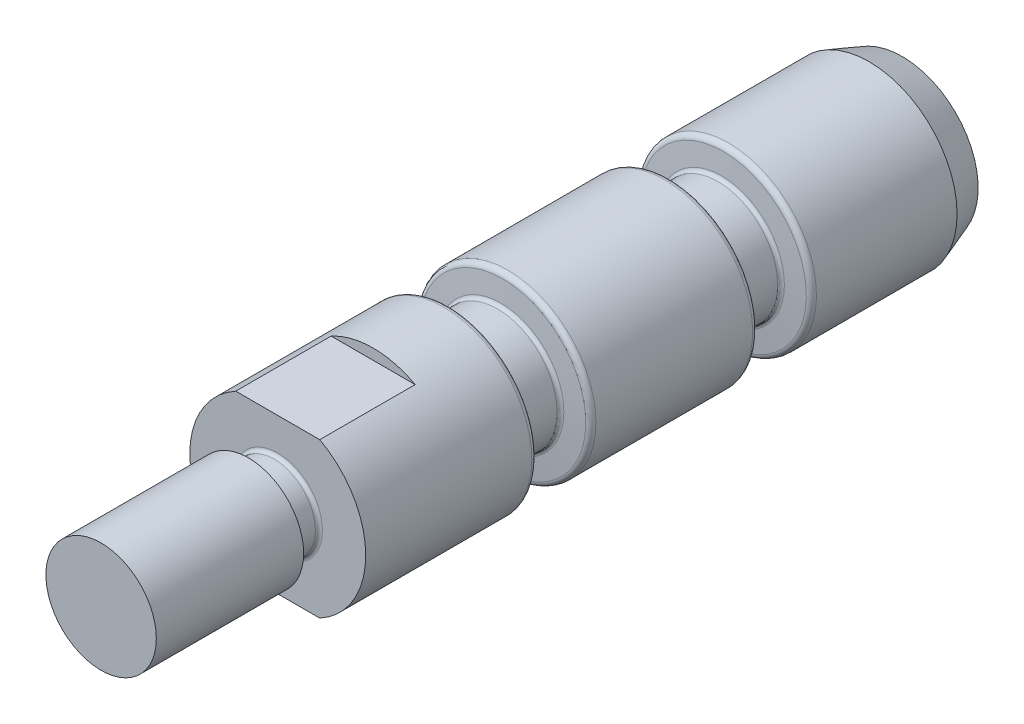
ISO-10303-21;
HEADER;
FILE_DESCRIPTION(('STEP AP214'),'2;1');
FILE_NAME('part.step','',(''),(''),'','','');
FILE_SCHEMA(('AUTOMOTIVE_DESIGN { 1 0 10303 214 1 1 1 1 }'));
ENDSEC;
DATA;
#1=APPLICATION_CONTEXT('core data for automotive mechanical design processes');
#2=APPLICATION_PROTOCOL_DEFINITION('international standard','automotive_design',2000,#1);
#3=PRODUCT_CONTEXT('',#1,'mechanical');
#4=PRODUCT('Part','Part','',(#3));
#5=PRODUCT_RELATED_PRODUCT_CATEGORY('part','',(#4));
#6=PRODUCT_DEFINITION_FORMATION('','',#4);
#7=PRODUCT_DEFINITION_CONTEXT('part definition',#1,'design');
#8=PRODUCT_DEFINITION('design','',#6,#7);
#9=PRODUCT_DEFINITION_SHAPE('','',#8);
#10=(LENGTH_UNIT() NAMED_UNIT(*) SI_UNIT(.MILLI.,.METRE.));
#11=(NAMED_UNIT(*) PLANE_ANGLE_UNIT() SI_UNIT($,.RADIAN.));
#12=(NAMED_UNIT(*) SI_UNIT($,.STERADIAN.) SOLID_ANGLE_UNIT());
#13=UNCERTAINTY_MEASURE_WITH_UNIT(LENGTH_MEASURE(1.E-05),#10,'distance_accuracy_value','');
#14=(GEOMETRIC_REPRESENTATION_CONTEXT(3) GLOBAL_UNCERTAINTY_ASSIGNED_CONTEXT((#13)) GLOBAL_UNIT_ASSIGNED_CONTEXT((#10,
#11,#12)) REPRESENTATION_CONTEXT('',''));
#15=CARTESIAN_POINT('',(0.,0.,0.));
#16=DIRECTION('',(0.,0.,1.));
#17=DIRECTION('',(1.,0.,0.));
#18=AXIS2_PLACEMENT_3D('',#15,#16,#17);
#19=CARTESIAN_POINT('',(-82.55,82.5500000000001,-44.8945));
#20=DIRECTION('',(0.,0.,1.));
#21=DIRECTION('',(1.,0.,0.));
#22=AXIS2_PLACEMENT_3D('',#19,#20,#21);
#23=CYLINDRICAL_SURFACE('',#22,6.32459999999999);
#24=CARTESIAN_POINT('',(-82.55,82.5500000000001,-11.9403527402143));
#25=DIRECTION('',(0.,0.,1.));
#26=DIRECTION('',(0.,-1.,0.));
#27=AXIS2_PLACEMENT_3D('',#24,#25,#26);
#28=CIRCLE('',#27,6.32459999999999);
#29=CARTESIAN_POINT('',(-82.55,76.2254000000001,-11.9403527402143));
#30=VERTEX_POINT('',#29);
#31=EDGE_CURVE('E135',#30,#30,#28,.T.);
#32=ORIENTED_EDGE('',*,*,#31,.T.);
#33=EDGE_LOOP('',(#32));
#34=FACE_BOUND('',#33,.T.);
#35=CARTESIAN_POINT('',(-82.55,82.5500000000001,-6.858));
#36=DIRECTION('',(0.,0.,-1.));
#37=DIRECTION('',(-1.,0.,0.));
#38=AXIS2_PLACEMENT_3D('',#35,#36,#37);
#39=CIRCLE('',#38,6.32459999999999);
#40=CARTESIAN_POINT('',(-79.5286342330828,76.99375,-6.858));
#41=VERTEX_POINT('',#40);
#42=CARTESIAN_POINT('',(-85.5713657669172,76.99375,-6.858));
#43=VERTEX_POINT('',#42);
#44=EDGE_CURVE('E89',#41,#43,#39,.T.);
#45=ORIENTED_EDGE('',*,*,#44,.T.);
#46=DIRECTION('',(0.,0.,1.));
#47=VECTOR('',#46,1.);
#48=CARTESIAN_POINT('',(-85.5713657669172,76.99375,-44.8945));
#49=LINE('',#48,#47);
#50=CARTESIAN_POINT('',(-85.5713657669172,76.99375,0.));
#51=VERTEX_POINT('',#50);
#52=EDGE_CURVE('E84',#43,#51,#49,.T.);
#53=ORIENTED_EDGE('',*,*,#52,.T.);
#54=CARTESIAN_POINT('',(-82.55,82.5500000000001,0.));
#55=DIRECTION('',(0.,0.,-1.));
#56=DIRECTION('',(-1.,0.,0.));
#57=AXIS2_PLACEMENT_3D('',#54,#55,#56);
#58=CIRCLE('',#57,6.32459999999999);
#59=CARTESIAN_POINT('',(-85.5713657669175,88.10625,0.));
#60=VERTEX_POINT('',#59);
#61=EDGE_CURVE('E61',#51,#60,#58,.T.);
#62=ORIENTED_EDGE('',*,*,#61,.T.);
#63=DIRECTION('',(0.,0.,1.));
#64=VECTOR('',#63,1.);
#65=CARTESIAN_POINT('',(-85.5713657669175,88.10625,-44.8945));
#66=LINE('',#65,#64);
#67=CARTESIAN_POINT('',(-85.5713657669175,88.10625,-6.858));
#68=VERTEX_POINT('',#67);
#69=EDGE_CURVE('E202',#60,#68,#66,.F.);
#70=ORIENTED_EDGE('',*,*,#69,.T.);
#71=CARTESIAN_POINT('',(-82.55,82.5500000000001,-6.85800000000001));
#72=DIRECTION('',(0.,0.,-1.));
#73=DIRECTION('',(0.,1.,0.));
#74=AXIS2_PLACEMENT_3D('',#71,#72,#73);
#75=CIRCLE('',#74,6.32459999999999);
#76=CARTESIAN_POINT('',(-79.5286342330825,88.10625,-6.858));
#77=VERTEX_POINT('',#76);
#78=EDGE_CURVE('E90',#68,#77,#75,.T.);
#79=ORIENTED_EDGE('',*,*,#78,.T.);
#80=DIRECTION('',(0.,0.,1.));
#81=VECTOR('',#80,1.);
#82=CARTESIAN_POINT('',(-79.5286342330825,88.10625,-44.8945));
#83=LINE('',#82,#81);
#84=CARTESIAN_POINT('',(-79.5286342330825,88.10625,0.));
#85=VERTEX_POINT('',#84);
#86=EDGE_CURVE('E196',#77,#85,#83,.T.);
#87=ORIENTED_EDGE('',*,*,#86,.T.);
#88=CARTESIAN_POINT('',(-79.5286342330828,76.99375,0.));
#89=VERTEX_POINT('',#88);
#90=EDGE_CURVE('E99',#85,#89,#58,.T.);
#91=ORIENTED_EDGE('',*,*,#90,.T.);
#92=DIRECTION('',(0.,0.,1.));
#93=VECTOR('',#92,1.);
#94=CARTESIAN_POINT('',(-79.5286342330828,76.99375,-44.8945));
#95=LINE('',#94,#93);
#96=EDGE_CURVE('E53',#89,#41,#95,.F.);
#97=ORIENTED_EDGE('',*,*,#96,.T.);
#98=EDGE_LOOP('',(#45,#53,#62,#70,#79,#87,#91,#97));
#99=FACE_BOUND('',#98,.T.);
#100=ADVANCED_FACE('F38',(#34,#99),#23,.T.);
#101=CARTESIAN_POINT('',(-82.55,82.5500000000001,0.));
#102=DIRECTION('',(0.,0.,-1.));
#103=DIRECTION('',(-1.,0.,0.));
#104=AXIS2_PLACEMENT_3D('',#101,#102,#103);
#105=PLANE('',#104);
#106=ORIENTED_EDGE('',*,*,#61,.F.);
#107=DIRECTION('',(1.,0.,0.));
#108=VECTOR('',#107,1.);
#109=CARTESIAN_POINT('',(-82.55,76.99375,0.));
#110=LINE('',#109,#108);
#111=EDGE_CURVE('E82',#51,#89,#110,.T.);
#112=ORIENTED_EDGE('',*,*,#111,.T.);
#113=ORIENTED_EDGE('',*,*,#90,.F.);
#114=DIRECTION('',(-1.,0.,0.));
#115=VECTOR('',#114,1.);
#116=CARTESIAN_POINT('',(-82.55,88.10625,0.));
#117=LINE('',#116,#115);
#118=EDGE_CURVE('E98',#85,#60,#117,.T.);
#119=ORIENTED_EDGE('',*,*,#118,.T.);
#120=EDGE_LOOP('',(#106,#112,#113,#119));
#121=FACE_BOUND('',#120,.T.);
#122=CARTESIAN_POINT('',(-82.55,82.55,0.));
#123=DIRECTION('',(0.,0.,1.));
#124=DIRECTION('',(1.,0.,0.));
#125=AXIS2_PLACEMENT_3D('',#122,#123,#124);
#126=CIRCLE('',#125,3.21310000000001);
#127=CARTESIAN_POINT('',(-79.3369,82.55,0.));
#128=VERTEX_POINT('',#127);
#129=EDGE_CURVE('E100',#128,#128,#126,.T.);
#130=ORIENTED_EDGE('',*,*,#129,.F.);
#131=EDGE_LOOP('',(#130));
#132=FACE_BOUND('',#131,.T.);
#133=ADVANCED_FACE('F96',(#121,#132),#105,.F.);
#134=CARTESIAN_POINT('',(-82.55,82.55,0.254));
#135=DIRECTION('',(0.,0.,1.));
#136=DIRECTION('',(1.,0.,0.));
#137=AXIS2_PLACEMENT_3D('',#134,#135,#136);
#138=TOROIDAL_SURFACE('',#137,3.21310000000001,0.254000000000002);
#139=ORIENTED_EDGE('',*,*,#129,.T.);
#140=EDGE_LOOP('',(#139));
#141=FACE_BOUND('',#140,.T.);
#142=CARTESIAN_POINT('',(-82.55,82.55,0.254000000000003));
#143=DIRECTION('',(0.,0.,1.));
#144=DIRECTION('',(1.,0.,0.));
#145=AXIS2_PLACEMENT_3D('',#142,#143,#144);
#146=CIRCLE('',#145,2.95910000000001);
#147=CARTESIAN_POINT('',(-79.5909,82.55,0.254000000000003));
#148=VERTEX_POINT('',#147);
#149=EDGE_CURVE('E104',#148,#148,#146,.T.);
#150=ORIENTED_EDGE('',*,*,#149,.F.);
#151=EDGE_LOOP('',(#150));
#152=FACE_BOUND('',#151,.T.);
#153=ADVANCED_FACE('F160',(#141,#152),#138,.F.);
#154=CARTESIAN_POINT('',(-82.55,82.55,12.7));
#155=DIRECTION('',(0.,0.,1.));
#156=DIRECTION('',(1.,0.,0.));
#157=AXIS2_PLACEMENT_3D('',#154,#155,#156);
#158=CYLINDRICAL_SURFACE('',#157,2.95910000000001);
#159=ORIENTED_EDGE('',*,*,#149,.T.);
#160=EDGE_LOOP('',(#159));
#161=FACE_BOUND('',#160,.T.);
#162=CARTESIAN_POINT('',(-82.55,82.55,1.8542));
#163=DIRECTION('',(0.,0.,1.));
#164=DIRECTION('',(1.,0.,0.));
#165=AXIS2_PLACEMENT_3D('',#162,#163,#164);
#166=CIRCLE('',#165,2.95910000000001);
#167=CARTESIAN_POINT('',(-79.5909,82.55,1.8542));
#168=VERTEX_POINT('',#167);
#169=EDGE_CURVE('E235',#168,#168,#166,.T.);
#170=ORIENTED_EDGE('',*,*,#169,.F.);
#171=EDGE_LOOP('',(#170));
#172=FACE_BOUND('',#171,.T.);
#173=ADVANCED_FACE('F240',(#161,#172),#158,.T.);
#174=CARTESIAN_POINT('',(-82.55,82.55,1.8542));
#175=DIRECTION('',(0.,0.,1.));
#176=DIRECTION('',(1.,0.,0.));
#177=AXIS2_PLACEMENT_3D('',#174,#175,#176);
#178=TOROIDAL_SURFACE('',#177,3.21310000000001,0.254000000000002);
#179=ORIENTED_EDGE('',*,*,#169,.T.);
#180=EDGE_LOOP('',(#179));
#181=FACE_BOUND('',#180,.T.);
#182=CARTESIAN_POINT('',(-82.55,82.55,2.1082));
#183=DIRECTION('',(0.,0.,1.));
#184=DIRECTION('',(1.,0.,0.));
#185=AXIS2_PLACEMENT_3D('',#182,#183,#184);
#186=CIRCLE('',#185,3.21310000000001);
#187=CARTESIAN_POINT('',(-79.3369,82.55,2.1082));
#188=VERTEX_POINT('',#187);
#189=EDGE_CURVE('E232',#188,#188,#186,.T.);
#190=ORIENTED_EDGE('',*,*,#189,.F.);
#191=EDGE_LOOP('',(#190));
#192=FACE_BOUND('',#191,.T.);
#193=ADVANCED_FACE('F249',(#181,#192),#178,.F.);
#194=CARTESIAN_POINT('',(-82.55,86.51875,2.1082));
#195=DIRECTION('',(0.,0.,-1.));
#196=DIRECTION('',(-1.,0.,0.));
#197=AXIS2_PLACEMENT_3D('',#194,#195,#196);
#198=PLANE('',#197);
#199=ORIENTED_EDGE('',*,*,#189,.T.);
#200=EDGE_LOOP('',(#199));
#201=FACE_BOUND('',#200,.T.);
#202=CARTESIAN_POINT('',(-82.55,82.55,2.1082));
#203=DIRECTION('',(0.,0.,1.));
#204=DIRECTION('',(1.,0.,0.));
#205=AXIS2_PLACEMENT_3D('',#202,#203,#204);
#206=CIRCLE('',#205,3.96874999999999);
#207=CARTESIAN_POINT('',(-78.58125,82.55,2.1082));
#208=VERTEX_POINT('',#207);
#209=EDGE_CURVE('E229',#208,#208,#206,.T.);
#210=ORIENTED_EDGE('',*,*,#209,.F.);
#211=EDGE_LOOP('',(#210));
#212=FACE_BOUND('',#211,.T.);
#213=ADVANCED_FACE('F254',(#201,#212),#198,.T.);
#214=CARTESIAN_POINT('',(-82.55,82.55,12.7));
#215=DIRECTION('',(0.,0.,1.));
#216=DIRECTION('',(1.,0.,0.));
#217=AXIS2_PLACEMENT_3D('',#214,#215,#216);
#218=PLANE('',#217);
#219=CARTESIAN_POINT('',(-82.55,82.55,12.7));
#220=DIRECTION('',(0.,0.,1.));
#221=DIRECTION('',(1.,0.,0.));
#222=AXIS2_PLACEMENT_3D('',#219,#220,#221);
#223=CIRCLE('',#222,3.96874999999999);
#224=CARTESIAN_POINT('',(-78.58125,82.55,12.7));
#225=VERTEX_POINT('',#224);
#226=EDGE_CURVE('E102',#225,#225,#223,.T.);
#227=ORIENTED_EDGE('',*,*,#226,.T.);
#228=EDGE_LOOP('',(#227));
#229=FACE_BOUND('',#228,.T.);
#230=ADVANCED_FACE('F258',(#229),#218,.T.);
#231=CARTESIAN_POINT('',(-82.55,82.55,12.7));
#232=DIRECTION('',(0.,0.,-1.));
#233=DIRECTION('',(-1.,0.,0.));
#234=AXIS2_PLACEMENT_3D('',#231,#232,#233);
#235=CYLINDRICAL_SURFACE('',#234,3.96874999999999);
#236=ORIENTED_EDGE('',*,*,#226,.F.);
#237=EDGE_LOOP('',(#236));
#238=FACE_BOUND('',#237,.T.);
#239=ORIENTED_EDGE('',*,*,#209,.T.);
#240=EDGE_LOOP('',(#239));
#241=FACE_BOUND('',#240,.T.);
#242=ADVANCED_FACE('F282',(#238,#241),#235,.T.);
#243=CARTESIAN_POINT('',(-82.55,82.5500000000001,-12.2480552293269));
#244=DIRECTION('',(0.,0.,1.));
#245=DIRECTION('',(0.,-1.,0.));
#246=AXIS2_PLACEMENT_3D('',#243,#244,#245);
#247=CONICAL_SURFACE('',#246,6.7980292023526,1.48352986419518);
#248=CARTESIAN_POINT('',(-82.55,82.5500000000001,-12.3199029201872));
#249=DIRECTION('',(0.,0.,1.));
#250=DIRECTION('',(0.,-1.,0.));
#251=AXIS2_PLACEMENT_3D('',#248,#249,#250);
#252=CIRCLE('',#251,5.97680633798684);
#253=CARTESIAN_POINT('',(-82.55,76.5731936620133,-12.3199029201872));
#254=VERTEX_POINT('',#253);
#255=EDGE_CURVE('E132',#254,#254,#252,.F.);
#256=ORIENTED_EDGE('',*,*,#255,.T.);
#257=EDGE_LOOP('',(#256));
#258=FACE_BOUND('',#257,.T.);
#259=CARTESIAN_POINT('',(-82.55,82.5500000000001,-12.4469665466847));
#260=DIRECTION('',(0.,0.,1.));
#261=DIRECTION('',(0.,-1.,0.));
#262=AXIS2_PLACEMENT_3D('',#259,#260,#261);
#263=CIRCLE('',#262,4.52446244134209);
#264=CARTESIAN_POINT('',(-82.55,78.025537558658,-12.4469665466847));
#265=VERTEX_POINT('',#264);
#266=EDGE_CURVE('E214',#265,#265,#263,.T.);
#267=ORIENTED_EDGE('',*,*,#266,.T.);
#268=EDGE_LOOP('',(#267));
#269=FACE_BOUND('',#268,.T.);
#270=ADVANCED_FACE('F279',(#258,#269),#247,.T.);
#271=CARTESIAN_POINT('',(-82.55,82.5500000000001,-16.0435372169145));
#272=DIRECTION('',(0.,0.,-1.));
#273=DIRECTION('',(0.,1.,0.));
#274=AXIS2_PLACEMENT_3D('',#271,#272,#273);
#275=CONICAL_SURFACE('',#274,4.5244624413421,1.48352986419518);
#276=CARTESIAN_POINT('',(-82.55,82.5500000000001,-16.1706008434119));
#277=DIRECTION('',(0.,0.,-1.));
#278=DIRECTION('',(0.,1.,0.));
#279=AXIS2_PLACEMENT_3D('',#276,#277,#278);
#280=CIRCLE('',#279,5.97680633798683);
#281=CARTESIAN_POINT('',(-82.55,88.5268063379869,-16.1706008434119));
#282=VERTEX_POINT('',#281);
#283=EDGE_CURVE('E120',#282,#282,#280,.F.);
#284=ORIENTED_EDGE('',*,*,#283,.T.);
#285=EDGE_LOOP('',(#284));
#286=FACE_BOUND('',#285,.T.);
#287=CARTESIAN_POINT('',(-82.55,82.5500000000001,-16.0435372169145));
#288=DIRECTION('',(0.,0.,1.));
#289=DIRECTION('',(0.,-1.,0.));
#290=AXIS2_PLACEMENT_3D('',#287,#288,#289);
#291=CIRCLE('',#290,4.52446244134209);
#292=CARTESIAN_POINT('',(-82.55,78.025537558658,-16.0435372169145));
#293=VERTEX_POINT('',#292);
#294=EDGE_CURVE('E211',#293,#293,#291,.T.);
#295=ORIENTED_EDGE('',*,*,#294,.F.);
#296=EDGE_LOOP('',(#295));
#297=FACE_BOUND('',#296,.T.);
#298=ADVANCED_FACE('F277',(#286,#297),#275,.T.);
#299=CARTESIAN_POINT('',(-82.55,82.5500000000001,-12.7));
#300=DIRECTION('',(0.,0.,1.));
#301=DIRECTION('',(0.,-1.,0.));
#302=AXIS2_PLACEMENT_3D('',#299,#300,#301);
#303=TOROIDAL_SURFACE('',#302,4.5466,0.253999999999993);
#304=CARTESIAN_POINT('',(-82.55,82.5500000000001,-12.7));
#305=DIRECTION('',(0.,0.,1.));
#306=DIRECTION('',(0.,-1.,0.));
#307=AXIS2_PLACEMENT_3D('',#304,#305,#306);
#308=CIRCLE('',#307,4.2926);
#309=CARTESIAN_POINT('',(-82.55,78.2574000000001,-12.7));
#310=VERTEX_POINT('',#309);
#311=EDGE_CURVE('E199',#310,#310,#308,.T.);
#312=ORIENTED_EDGE('',*,*,#311,.T.);
#313=EDGE_LOOP('',(#312));
#314=FACE_BOUND('',#313,.T.);
#315=ORIENTED_EDGE('',*,*,#266,.F.);
#316=EDGE_LOOP('',(#315));
#317=FACE_BOUND('',#316,.T.);
#318=ADVANCED_FACE('F273',(#314,#317),#303,.F.);
#319=CARTESIAN_POINT('',(-82.55,82.5500000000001,-15.7905037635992));
#320=DIRECTION('',(0.,0.,1.));
#321=DIRECTION('',(0.,-1.,0.));
#322=AXIS2_PLACEMENT_3D('',#319,#320,#321);
#323=TOROIDAL_SURFACE('',#322,4.54659999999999,0.253999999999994);
#324=ORIENTED_EDGE('',*,*,#294,.T.);
#325=EDGE_LOOP('',(#324));
#326=FACE_BOUND('',#325,.T.);
#327=CARTESIAN_POINT('',(-82.55,82.5500000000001,-15.7905037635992));
#328=DIRECTION('',(0.,0.,1.));
#329=DIRECTION('',(0.,-1.,0.));
#330=AXIS2_PLACEMENT_3D('',#327,#328,#329);
#331=CIRCLE('',#330,4.2926);
#332=CARTESIAN_POINT('',(-82.55,78.2574000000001,-15.7905037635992));
#333=VERTEX_POINT('',#332);
#334=EDGE_CURVE('E208',#333,#333,#331,.T.);
#335=ORIENTED_EDGE('',*,*,#334,.F.);
#336=EDGE_LOOP('',(#335));
#337=FACE_BOUND('',#336,.T.);
#338=ADVANCED_FACE('F276',(#326,#337),#323,.F.);
#339=CARTESIAN_POINT('',(-82.55,82.5500000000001,7.13749999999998));
#340=DIRECTION('',(0.,0.,1.));
#341=DIRECTION('',(0.,-1.,0.));
#342=AXIS2_PLACEMENT_3D('',#339,#340,#341);
#343=CYLINDRICAL_SURFACE('',#342,4.29260000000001);
#344=ORIENTED_EDGE('',*,*,#334,.T.);
#345=EDGE_LOOP('',(#344));
#346=FACE_BOUND('',#345,.T.);
#347=ORIENTED_EDGE('',*,*,#311,.F.);
#348=EDGE_LOOP('',(#347));
#349=FACE_BOUND('',#348,.T.);
#350=ADVANCED_FACE('F177',(#346,#349),#343,.T.);
#351=CARTESIAN_POINT('',(-82.55,82.5500000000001,-44.8945));
#352=DIRECTION('',(0.,0.,-1.));
#353=DIRECTION('',(-1.,0.,0.));
#354=AXIS2_PLACEMENT_3D('',#351,#352,#353);
#355=PLANE('',#354);
#356=CARTESIAN_POINT('',(-82.55,82.5500000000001,-44.8945));
#357=DIRECTION('',(0.,0.,-1.));
#358=DIRECTION('',(-1.,0.,0.));
#359=AXIS2_PLACEMENT_3D('',#356,#357,#358);
#360=CIRCLE('',#359,5.45789587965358);
#361=CARTESIAN_POINT('',(-88.0078958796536,82.5500000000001,-44.8945));
#362=VERTEX_POINT('',#361);
#363=EDGE_CURVE('E114',#362,#362,#360,.T.);
#364=ORIENTED_EDGE('',*,*,#363,.T.);
#365=EDGE_LOOP('',(#364));
#366=FACE_BOUND('',#365,.T.);
#367=CARTESIAN_POINT('',(-82.55,82.5500000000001,-44.8945));
#368=DIRECTION('',(0.,0.,-1.));
#369=DIRECTION('',(-1.,0.,0.));
#370=AXIS2_PLACEMENT_3D('',#367,#368,#369);
#371=CIRCLE('',#370,2.6543);
#372=CARTESIAN_POINT('',(-85.2043,82.5500000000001,-44.8945));
#373=VERTEX_POINT('',#372);
#374=EDGE_CURVE('E193',#373,#373,#371,.T.);
#375=ORIENTED_EDGE('',*,*,#374,.F.);
#376=EDGE_LOOP('',(#375));
#377=FACE_BOUND('',#376,.T.);
#378=ADVANCED_FACE('F168',(#366,#377),#355,.T.);
#379=CARTESIAN_POINT('',(-82.55,82.5500000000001,-32.40486568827));
#380=DIRECTION('',(0.,0.,-1.));
#381=DIRECTION('',(0.,1.,0.));
#382=AXIS2_PLACEMENT_3D('',#379,#380,#381);
#383=CIRCLE('',#382,6.32459999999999);
#384=CARTESIAN_POINT('',(-82.55,88.8746000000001,-32.40486568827));
#385=VERTEX_POINT('',#384);
#386=EDGE_CURVE('E129',#385,#385,#383,.T.);
#387=ORIENTED_EDGE('',*,*,#386,.T.);
#388=EDGE_LOOP('',(#387));
#389=FACE_BOUND('',#388,.T.);
#390=CARTESIAN_POINT('',(-82.55,82.5500000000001,-42.5132499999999));
#391=DIRECTION('',(0.,0.,-1.));
#392=DIRECTION('',(-1.,0.,0.));
#393=AXIS2_PLACEMENT_3D('',#390,#391,#392);
#394=CIRCLE('',#393,6.32459999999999);
#395=CARTESIAN_POINT('',(-88.8746,82.5500000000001,-42.5132499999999));
#396=VERTEX_POINT('',#395);
#397=EDGE_CURVE('E117',#396,#396,#394,.F.);
#398=ORIENTED_EDGE('',*,*,#397,.T.);
#399=EDGE_LOOP('',(#398));
#400=FACE_BOUND('',#399,.T.);
#401=ADVANCED_FACE('F156',(#389,#400),#23,.T.);
#402=CARTESIAN_POINT('',(-82.55,82.5500000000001,-31.8982518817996));
#403=DIRECTION('',(0.,0.,-1.));
#404=DIRECTION('',(0.,1.,0.));
#405=AXIS2_PLACEMENT_3D('',#402,#403,#404);
#406=CONICAL_SURFACE('',#405,4.5244624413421,1.48352986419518);
#407=CARTESIAN_POINT('',(-82.55,82.5500000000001,-32.0253155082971));
#408=DIRECTION('',(0.,0.,-1.));
#409=DIRECTION('',(0.,1.,0.));
#410=AXIS2_PLACEMENT_3D('',#407,#408,#409);
#411=CIRCLE('',#410,5.97680633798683);
#412=CARTESIAN_POINT('',(-82.55,88.5268063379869,-32.0253155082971));
#413=VERTEX_POINT('',#412);
#414=EDGE_CURVE('E126',#413,#413,#411,.F.);
#415=ORIENTED_EDGE('',*,*,#414,.T.);
#416=EDGE_LOOP('',(#415));
#417=FACE_BOUND('',#416,.T.);
#418=CARTESIAN_POINT('',(-82.55,82.5500000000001,-31.8982518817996));
#419=DIRECTION('',(0.,0.,1.));
#420=DIRECTION('',(0.,-1.,0.));
#421=AXIS2_PLACEMENT_3D('',#418,#419,#420);
#422=CIRCLE('',#421,4.52446244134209);
#423=CARTESIAN_POINT('',(-82.55,78.025537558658,-31.8982518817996));
#424=VERTEX_POINT('',#423);
#425=EDGE_CURVE('E223',#424,#424,#422,.T.);
#426=ORIENTED_EDGE('',*,*,#425,.F.);
#427=EDGE_LOOP('',(#426));
#428=FACE_BOUND('',#427,.T.);
#429=ADVANCED_FACE('F167',(#417,#428),#406,.T.);
#430=CARTESIAN_POINT('',(-82.55,82.5500000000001,-31.6452184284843));
#431=DIRECTION('',(0.,0.,1.));
#432=DIRECTION('',(0.,-1.,0.));
#433=AXIS2_PLACEMENT_3D('',#430,#431,#432);
#434=TOROIDAL_SURFACE('',#433,4.54659999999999,0.253999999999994);
#435=ORIENTED_EDGE('',*,*,#425,.T.);
#436=EDGE_LOOP('',(#435));
#437=FACE_BOUND('',#436,.T.);
#438=CARTESIAN_POINT('',(-82.55,82.5500000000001,-31.6452184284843));
#439=DIRECTION('',(0.,0.,1.));
#440=DIRECTION('',(0.,-1.,0.));
#441=AXIS2_PLACEMENT_3D('',#438,#439,#440);
#442=CIRCLE('',#441,4.2926);
#443=CARTESIAN_POINT('',(-82.55,78.2574000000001,-31.6452184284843));
#444=VERTEX_POINT('',#443);
#445=EDGE_CURVE('E220',#444,#444,#442,.T.);
#446=ORIENTED_EDGE('',*,*,#445,.F.);
#447=EDGE_LOOP('',(#446));
#448=FACE_BOUND('',#447,.T.);
#449=ADVANCED_FACE('F174',(#437,#448),#434,.F.);
#450=CARTESIAN_POINT('',(-82.55,82.5500000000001,7.13749999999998));
#451=DIRECTION('',(0.,0.,1.));
#452=DIRECTION('',(0.,-1.,0.));
#453=AXIS2_PLACEMENT_3D('',#450,#451,#452);
#454=CYLINDRICAL_SURFACE('',#453,4.29260000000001);
#455=ORIENTED_EDGE('',*,*,#445,.T.);
#456=EDGE_LOOP('',(#455));
#457=FACE_BOUND('',#456,.T.);
#458=CARTESIAN_POINT('',(-82.55,82.5500000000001,-28.575));
#459=DIRECTION('',(0.,0.,1.));
#460=DIRECTION('',(0.,-1.,0.));
#461=AXIS2_PLACEMENT_3D('',#458,#459,#460);
#462=CIRCLE('',#461,4.2926);
#463=CARTESIAN_POINT('',(-82.55,78.2574000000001,-28.575));
#464=VERTEX_POINT('',#463);
#465=EDGE_CURVE('E217',#464,#464,#462,.T.);
#466=ORIENTED_EDGE('',*,*,#465,.F.);
#467=EDGE_LOOP('',(#466));
#468=FACE_BOUND('',#467,.T.);
#469=ADVANCED_FACE('F263',(#457,#468),#454,.T.);
#470=CARTESIAN_POINT('',(-82.55,82.5500000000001,-28.575));
#471=DIRECTION('',(0.,0.,1.));
#472=DIRECTION('',(0.,-1.,0.));
#473=AXIS2_PLACEMENT_3D('',#470,#471,#472);
#474=TOROIDAL_SURFACE('',#473,4.54659999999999,0.253999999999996);
#475=ORIENTED_EDGE('',*,*,#465,.T.);
#476=EDGE_LOOP('',(#475));
#477=FACE_BOUND('',#476,.T.);
#478=CARTESIAN_POINT('',(-82.55,82.5500000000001,-28.3219665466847));
#479=DIRECTION('',(0.,0.,1.));
#480=DIRECTION('',(0.,-1.,0.));
#481=AXIS2_PLACEMENT_3D('',#478,#479,#480);
#482=CIRCLE('',#481,4.52446244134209);
#483=CARTESIAN_POINT('',(-82.55,78.025537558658,-28.3219665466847));
#484=VERTEX_POINT('',#483);
#485=EDGE_CURVE('E226',#484,#484,#482,.T.);
#486=ORIENTED_EDGE('',*,*,#485,.F.);
#487=EDGE_LOOP('',(#486));
#488=FACE_BOUND('',#487,.T.);
#489=ADVANCED_FACE('F260',(#477,#488),#474,.F.);
#490=CARTESIAN_POINT('',(-82.55,82.5500000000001,-28.1582570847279));
#491=DIRECTION('',(0.,0.,1.));
#492=DIRECTION('',(0.,-1.,0.));
#493=AXIS2_PLACEMENT_3D('',#490,#491,#492);
#494=CONICAL_SURFACE('',#493,6.39567015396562,1.48352986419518);
#495=CARTESIAN_POINT('',(-82.55,82.5500000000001,-28.1949029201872));
#496=DIRECTION('',(0.,0.,1.));
#497=DIRECTION('',(0.,-1.,0.));
#498=AXIS2_PLACEMENT_3D('',#495,#496,#497);
#499=CIRCLE('',#498,5.97680633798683);
#500=CARTESIAN_POINT('',(-82.55,76.5731936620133,-28.1949029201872));
#501=VERTEX_POINT('',#500);
#502=EDGE_CURVE('E46',#501,#501,#499,.F.);
#503=ORIENTED_EDGE('',*,*,#502,.T.);
#504=EDGE_LOOP('',(#503));
#505=FACE_BOUND('',#504,.T.);
#506=ORIENTED_EDGE('',*,*,#485,.T.);
#507=EDGE_LOOP('',(#506));
#508=FACE_BOUND('',#507,.T.);
#509=ADVANCED_FACE('F140',(#505,#508),#494,.T.);
#510=CARTESIAN_POINT('',(-82.55,82.5500000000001,-27.8153527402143));
#511=DIRECTION('',(0.,0.,1.));
#512=DIRECTION('',(0.,-1.,0.));
#513=AXIS2_PLACEMENT_3D('',#510,#511,#512);
#514=CIRCLE('',#513,6.32459999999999);
#515=CARTESIAN_POINT('',(-82.55,76.2254000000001,-27.8153527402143));
#516=VERTEX_POINT('',#515);
#517=EDGE_CURVE('E11',#516,#516,#514,.T.);
#518=ORIENTED_EDGE('',*,*,#517,.T.);
#519=EDGE_LOOP('',(#518));
#520=FACE_BOUND('',#519,.T.);
#521=CARTESIAN_POINT('',(-82.55,82.5500000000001,-16.5501510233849));
#522=DIRECTION('',(0.,0.,-1.));
#523=DIRECTION('',(0.,1.,0.));
#524=AXIS2_PLACEMENT_3D('',#521,#522,#523);
#525=CIRCLE('',#524,6.32459999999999);
#526=CARTESIAN_POINT('',(-82.55,88.8746000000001,-16.5501510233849));
#527=VERTEX_POINT('',#526);
#528=EDGE_CURVE('E123',#527,#527,#525,.T.);
#529=ORIENTED_EDGE('',*,*,#528,.T.);
#530=EDGE_LOOP('',(#529));
#531=FACE_BOUND('',#530,.T.);
#532=ADVANCED_FACE('F155',(#520,#531),#23,.T.);
#533=CARTESIAN_POINT('',(-82.55,82.5500000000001,-33.1343));
#534=DIRECTION('',(0.,0.,-1.));
#535=DIRECTION('',(-1.,0.,0.));
#536=AXIS2_PLACEMENT_3D('',#533,#534,#535);
#537=CONICAL_SURFACE('',#536,2.6543,1.02974425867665);
#538=CARTESIAN_POINT('',(-82.55,82.5500000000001,-31.5394356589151));
#539=VERTEX_POINT('',#538);
#540=VERTEX_LOOP('',#539);
#541=FACE_BOUND('',#540,.T.);
#542=CARTESIAN_POINT('',(-82.55,82.5500000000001,-33.1343));
#543=DIRECTION('',(0.,0.,-1.));
#544=DIRECTION('',(-1.,0.,0.));
#545=AXIS2_PLACEMENT_3D('',#542,#543,#544);
#546=CIRCLE('',#545,2.6543);
#547=CARTESIAN_POINT('',(-85.2043,82.5500000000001,-33.1343));
#548=VERTEX_POINT('',#547);
#549=EDGE_CURVE('E195',#548,#548,#546,.T.);
#550=ORIENTED_EDGE('',*,*,#549,.T.);
#551=EDGE_LOOP('',(#550));
#552=FACE_BOUND('',#551,.T.);
#553=ADVANCED_FACE('F164',(#541,#552),#537,.F.);
#554=CARTESIAN_POINT('',(-82.55,82.5500000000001,-44.8945));
#555=DIRECTION('',(0.,0.,-1.));
#556=DIRECTION('',(-1.,0.,0.));
#557=AXIS2_PLACEMENT_3D('',#554,#555,#556);
#558=CYLINDRICAL_SURFACE('',#557,2.6543);
#559=ORIENTED_EDGE('',*,*,#549,.F.);
#560=EDGE_LOOP('',(#559));
#561=FACE_BOUND('',#560,.T.);
#562=ORIENTED_EDGE('',*,*,#374,.T.);
#563=EDGE_LOOP('',(#562));
#564=FACE_BOUND('',#563,.T.);
#565=ADVANCED_FACE('F295',(#561,#564),#558,.F.);
#566=CARTESIAN_POINT('',(-88.8746,91.5672871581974,-6.858));
#567=DIRECTION('',(0.,0.,-1.));
#568=DIRECTION('',(0.,1.,0.));
#569=AXIS2_PLACEMENT_3D('',#566,#567,#568);
#570=PLANE('',#569);
#571=DIRECTION('',(1.,0.,0.));
#572=VECTOR('',#571,1.);
#573=CARTESIAN_POINT('',(-88.8746,88.10625,-6.858));
#574=LINE('',#573,#572);
#575=EDGE_CURVE('E93',#68,#77,#574,.T.);
#576=ORIENTED_EDGE('',*,*,#575,.T.);
#577=ORIENTED_EDGE('',*,*,#78,.F.);
#578=EDGE_LOOP('',(#576,#577));
#579=FACE_BOUND('',#578,.T.);
#580=ADVANCED_FACE('F299',(#579),#570,.F.);
#581=CARTESIAN_POINT('',(-88.8746,88.10625,0.));
#582=DIRECTION('',(0.,-1.,0.));
#583=DIRECTION('',(0.,0.,-1.));
#584=AXIS2_PLACEMENT_3D('',#581,#582,#583);
#585=PLANE('',#584);
#586=ORIENTED_EDGE('',*,*,#575,.F.);
#587=ORIENTED_EDGE('',*,*,#69,.F.);
#588=ORIENTED_EDGE('',*,*,#118,.F.);
#589=ORIENTED_EDGE('',*,*,#86,.F.);
#590=EDGE_LOOP('',(#586,#587,#588,#589));
#591=FACE_BOUND('',#590,.T.);
#592=ADVANCED_FACE('F301',(#591),#585,.F.);
#593=CARTESIAN_POINT('',(-88.8746,74.607944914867,-6.858));
#594=DIRECTION('',(0.,0.,-1.));
#595=DIRECTION('',(-1.,0.,0.));
#596=AXIS2_PLACEMENT_3D('',#593,#594,#595);
#597=PLANE('',#596);
#598=DIRECTION('',(1.,0.,0.));
#599=VECTOR('',#598,1.);
#600=CARTESIAN_POINT('',(-88.8746,76.99375,-6.858));
#601=LINE('',#600,#599);
#602=EDGE_CURVE('E555',#43,#41,#601,.T.);
#603=ORIENTED_EDGE('',*,*,#602,.F.);
#604=ORIENTED_EDGE('',*,*,#44,.F.);
#605=EDGE_LOOP('',(#603,#604));
#606=FACE_BOUND('',#605,.T.);
#607=ADVANCED_FACE('F304',(#606),#597,.F.);
#608=CARTESIAN_POINT('',(-88.8746,76.99375,0.));
#609=DIRECTION('',(0.,1.,0.));
#610=DIRECTION('',(0.,0.,1.));
#611=AXIS2_PLACEMENT_3D('',#608,#609,#610);
#612=PLANE('',#611);
#613=ORIENTED_EDGE('',*,*,#602,.T.);
#614=ORIENTED_EDGE('',*,*,#96,.F.);
#615=ORIENTED_EDGE('',*,*,#111,.F.);
#616=ORIENTED_EDGE('',*,*,#52,.F.);
#617=EDGE_LOOP('',(#613,#614,#615,#616));
#618=FACE_BOUND('',#617,.T.);
#619=ADVANCED_FACE('F83',(#618),#612,.F.);
#620=CARTESIAN_POINT('',(-82.55,82.5500000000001,-44.8945));
#621=DIRECTION('',(0.,0.,1.));
#622=DIRECTION('',(1.,0.,0.));
#623=AXIS2_PLACEMENT_3D('',#620,#621,#622);
#624=CONICAL_SURFACE('',#623,5.45789587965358,0.349065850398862);
#625=ORIENTED_EDGE('',*,*,#397,.F.);
#626=EDGE_LOOP('',(#625));
#627=FACE_BOUND('',#626,.T.);
#628=ORIENTED_EDGE('',*,*,#363,.F.);
#629=EDGE_LOOP('',(#628));
#630=FACE_BOUND('',#629,.T.);
#631=ADVANCED_FACE('F184',(#627,#630),#624,.T.);
#632=CARTESIAN_POINT('',(-82.55,82.5500000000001,-16.5501510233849));
#633=DIRECTION('',(0.,0.,-1.));
#634=DIRECTION('',(0.,1.,0.));
#635=AXIS2_PLACEMENT_3D('',#632,#633,#634);
#636=TOROIDAL_SURFACE('',#635,5.94359999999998,0.381);
#637=ORIENTED_EDGE('',*,*,#528,.F.);
#638=EDGE_LOOP('',(#637));
#639=FACE_BOUND('',#638,.T.);
#640=ORIENTED_EDGE('',*,*,#283,.F.);
#641=EDGE_LOOP('',(#640));
#642=FACE_BOUND('',#641,.T.);
#643=ADVANCED_FACE('F187',(#639,#642),#636,.T.);
#644=CARTESIAN_POINT('',(-82.55,82.5500000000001,-32.40486568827));
#645=DIRECTION('',(0.,0.,-1.));
#646=DIRECTION('',(0.,1.,0.));
#647=AXIS2_PLACEMENT_3D('',#644,#645,#646);
#648=TOROIDAL_SURFACE('',#647,5.94359999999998,0.381);
#649=ORIENTED_EDGE('',*,*,#386,.F.);
#650=EDGE_LOOP('',(#649));
#651=FACE_BOUND('',#650,.T.);
#652=ORIENTED_EDGE('',*,*,#414,.F.);
#653=EDGE_LOOP('',(#652));
#654=FACE_BOUND('',#653,.T.);
#655=ADVANCED_FACE('F149',(#651,#654),#648,.T.);
#656=CARTESIAN_POINT('',(-82.55,82.5500000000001,-11.9403527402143));
#657=DIRECTION('',(0.,0.,1.));
#658=DIRECTION('',(0.,-1.,0.));
#659=AXIS2_PLACEMENT_3D('',#656,#657,#658);
#660=TOROIDAL_SURFACE('',#659,5.94359999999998,0.381);
#661=ORIENTED_EDGE('',*,*,#31,.F.);
#662=EDGE_LOOP('',(#661));
#663=FACE_BOUND('',#662,.T.);
#664=ORIENTED_EDGE('',*,*,#255,.F.);
#665=EDGE_LOOP('',(#664));
#666=FACE_BOUND('',#665,.T.);
#667=ADVANCED_FACE('F144',(#663,#666),#660,.T.);
#668=CARTESIAN_POINT('',(-82.55,82.5500000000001,-27.8153527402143));
#669=DIRECTION('',(0.,0.,1.));
#670=DIRECTION('',(0.,-1.,0.));
#671=AXIS2_PLACEMENT_3D('',#668,#669,#670);
#672=TOROIDAL_SURFACE('',#671,5.94359999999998,0.381);
#673=ORIENTED_EDGE('',*,*,#517,.F.);
#674=EDGE_LOOP('',(#673));
#675=FACE_BOUND('',#674,.T.);
#676=ORIENTED_EDGE('',*,*,#502,.F.);
#677=EDGE_LOOP('',(#676));
#678=FACE_BOUND('',#677,.T.);
#679=ADVANCED_FACE('F40',(#675,#678),#672,.T.);
#680=CLOSED_SHELL('',(#100,#133,#153,#173,#193,#213,#230,#242,#270,#298,#318,#338,#350,#378,
#401,#429,#449,#469,#489,#509,#532,#553,#565,#580,#592,#607,#619,#631,#643,#655,#667,#679));
#681=MANIFOLD_SOLID_BREP('B2',#680);
#682=ADVANCED_BREP_SHAPE_REPRESENTATION('',(#18,#681),#14);
#683=SHAPE_DEFINITION_REPRESENTATION(#9,#682);
ENDSEC;
END-ISO-10303-21;
